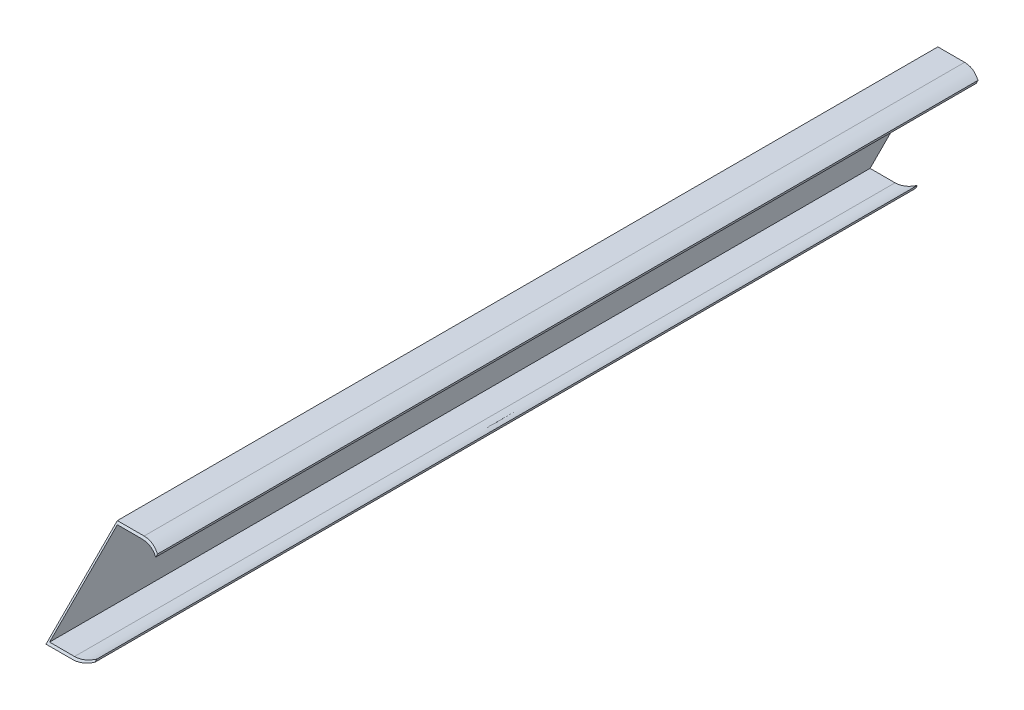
ISO-10303-21;
HEADER;
FILE_DESCRIPTION(('STEP AP214'),'2;1');
FILE_NAME('part.step','',(''),(''),'','','');
FILE_SCHEMA(('AUTOMOTIVE_DESIGN { 1 0 10303 214 1 1 1 1 }'));
ENDSEC;
DATA;
#1=APPLICATION_CONTEXT('core data for automotive mechanical design processes');
#2=APPLICATION_PROTOCOL_DEFINITION('international standard','automotive_design',2000,#1);
#3=PRODUCT_CONTEXT('',#1,'mechanical');
#4=PRODUCT('Part','Part','',(#3));
#5=PRODUCT_RELATED_PRODUCT_CATEGORY('part','',(#4));
#6=PRODUCT_DEFINITION_FORMATION('','',#4);
#7=PRODUCT_DEFINITION_CONTEXT('part definition',#1,'design');
#8=PRODUCT_DEFINITION('design','',#6,#7);
#9=PRODUCT_DEFINITION_SHAPE('','',#8);
#10=(LENGTH_UNIT() NAMED_UNIT(*) SI_UNIT(.MILLI.,.METRE.));
#11=(NAMED_UNIT(*) PLANE_ANGLE_UNIT() SI_UNIT($,.RADIAN.));
#12=(NAMED_UNIT(*) SI_UNIT($,.STERADIAN.) SOLID_ANGLE_UNIT());
#13=UNCERTAINTY_MEASURE_WITH_UNIT(LENGTH_MEASURE(1.E-05),#10,'distance_accuracy_value','');
#14=(GEOMETRIC_REPRESENTATION_CONTEXT(3) GLOBAL_UNCERTAINTY_ASSIGNED_CONTEXT((#13)) GLOBAL_UNIT_ASSIGNED_CONTEXT((#10,
#11,#12)) REPRESENTATION_CONTEXT('',''));
#15=CARTESIAN_POINT('',(0.,0.,0.));
#16=DIRECTION('',(0.,0.,1.));
#17=DIRECTION('',(1.,0.,0.));
#18=AXIS2_PLACEMENT_3D('',#15,#16,#17);
#19=CARTESIAN_POINT('',(0.,0.,1000.));
#20=DIRECTION('',(0.,1.,0.));
#21=DIRECTION('',(0.,0.,1.));
#22=AXIS2_PLACEMENT_3D('',#19,#20,#21);
#23=PLANE('',#22);
#24=DIRECTION('',(0.,0.,-1.));
#25=VECTOR('',#24,1.);
#26=CARTESIAN_POINT('',(0.,0.,1000.));
#27=LINE('',#26,#25);
#28=CARTESIAN_POINT('',(0.,0.,1000.));
#29=VERTEX_POINT('',#28);
#30=CARTESIAN_POINT('',(0.,0.,79.9999999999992));
#31=VERTEX_POINT('',#30);
#32=EDGE_CURVE('E148',#29,#31,#27,.T.);
#33=ORIENTED_EDGE('',*,*,#32,.T.);
#34=DIRECTION('',(-1.,0.,0.));
#35=VECTOR('',#34,1.);
#36=CARTESIAN_POINT('',(50.001,0.,79.9999999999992));
#37=LINE('',#36,#35);
#38=CARTESIAN_POINT('',(30.,0.,79.9999999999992));
#39=VERTEX_POINT('',#38);
#40=EDGE_CURVE('E340',#39,#31,#37,.T.);
#41=ORIENTED_EDGE('',*,*,#40,.F.);
#42=DIRECTION('',(0.,0.,-1.));
#43=VECTOR('',#42,1.);
#44=CARTESIAN_POINT('',(30.,0.,1000.));
#45=LINE('',#44,#43);
#46=CARTESIAN_POINT('',(30.,0.,1000.));
#47=VERTEX_POINT('',#46);
#48=EDGE_CURVE('E11',#47,#39,#45,.T.);
#49=ORIENTED_EDGE('',*,*,#48,.F.);
#50=DIRECTION('',(1.,0.,0.));
#51=VECTOR('',#50,1.);
#52=CARTESIAN_POINT('',(0.,0.,1000.));
#53=LINE('',#52,#51);
#54=EDGE_CURVE('E128',#29,#47,#53,.T.);
#55=ORIENTED_EDGE('',*,*,#54,.F.);
#56=EDGE_LOOP('',(#33,#41,#49,#55));
#57=FACE_BOUND('',#56,.T.);
#58=ADVANCED_FACE('F32',(#57),#23,.F.);
#59=CARTESIAN_POINT('',(30.,0.,1000.));
#60=CARTESIAN_POINT('',(40.6032812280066,0.0484567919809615,1000.));
#61=CARTESIAN_POINT('',(50.,5.,1000.));
#62=B_SPLINE_CURVE_WITH_KNOTS('',2,(#59,#60,#61),.UNSPECIFIED.,.F.,.F.,(3,3),(0.,1.),.UNSPECIFIED.);
#63=DIRECTION('',(0.,0.,-1.));
#64=VECTOR('',#63,1.);
#65=SURFACE_OF_LINEAR_EXTRUSION('',#62,#64);
#66=ORIENTED_EDGE('',*,*,#48,.T.);
#67=CARTESIAN_POINT('',(50.,5.,74.9999999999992));
#68=CARTESIAN_POINT('',(49.5210550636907,4.74761460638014,75.2523853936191));
#69=CARTESIAN_POINT('',(49.034728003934,4.50214773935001,75.4978522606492));
#70=CARTESIAN_POINT('',(48.0467010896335,4.02606279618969,75.9739372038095));
#71=CARTESIAN_POINT('',(47.5449794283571,3.7954673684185,76.2045326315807));
#72=CARTESIAN_POINT('',(46.5267291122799,3.35078644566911,76.6492135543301));
#73=CARTESIAN_POINT('',(46.0101932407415,3.13670919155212,76.8632908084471));
#74=CARTESIAN_POINT('',(44.9634416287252,2.7267907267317,77.2732092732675));
#75=CARTESIAN_POINT('',(44.4332389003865,2.530932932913,77.4690670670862));
#76=CARTESIAN_POINT('',(43.3596325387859,2.15871016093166,77.8412898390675));
#77=CARTESIAN_POINT('',(42.8162357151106,1.98233537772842,78.0176646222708));
#78=CARTESIAN_POINT('',(41.7171702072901,1.65035131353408,78.3496486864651));
#79=CARTESIAN_POINT('',(41.1615076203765,1.49473197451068,78.5052680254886));
#80=CARTESIAN_POINT('',(40.1825845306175,1.24237137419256,78.7576286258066));
#81=CARTESIAN_POINT('',(39.7618260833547,1.14075340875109,78.8592465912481));
#82=CARTESIAN_POINT('',(38.9146879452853,0.950024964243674,79.0499750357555));
#83=CARTESIAN_POINT('',(38.4883085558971,0.860913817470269,79.1390861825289));
#84=CARTESIAN_POINT('',(37.6310401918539,0.695625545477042,79.3043744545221));
#85=CARTESIAN_POINT('',(37.2001563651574,0.61943507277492,79.3805649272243));
#86=CARTESIAN_POINT('',(36.3341748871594,0.480132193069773,79.5198678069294));
#87=CARTESIAN_POINT('',(35.8990771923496,0.417019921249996,79.5829800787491));
#88=CARTESIAN_POINT('',(35.0123765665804,0.302350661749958,79.6976493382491));
#89=CARTESIAN_POINT('',(34.5606694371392,0.251196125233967,79.7488038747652));
#90=CARTESIAN_POINT('',(33.6544975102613,0.163011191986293,79.8369888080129));
#91=CARTESIAN_POINT('',(33.2000326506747,0.125981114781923,79.8740188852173));
#92=CARTESIAN_POINT('',(32.2884626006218,0.0659644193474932,79.9340355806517));
#93=CARTESIAN_POINT('',(31.831354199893,0.0430022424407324,79.9569977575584));
#94=CARTESIAN_POINT('',(30.9161801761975,0.0110581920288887,79.9889418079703));
#95=CARTESIAN_POINT('',(30.4581145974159,0.00207568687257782,79.9979243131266));
#96=CARTESIAN_POINT('',(30.,0.,79.9999999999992));
#97=B_SPLINE_CURVE_WITH_KNOTS('',3,(#67,#68,#69,#70,#71,#72,#73,#74,#75,#76,#77,#78,#79,#80,#81,
#82,#83,#84,#85,#86,#87,#88,#89,#90,#91,#92,#93,#94,#95,#96),.UNSPECIFIED.,.F.,.F.,(4,2,2,2,2,2,
2,2,2,2,2,2,2,2,4),(0.,1.7919271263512,3.58652177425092,5.38200602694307,7.17583972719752,
8.96876650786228,10.7608212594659,12.094332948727,13.4277734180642,14.7598278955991,
16.0918961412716,17.4638388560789,18.8358126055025,20.2101632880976,21.5844518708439),.UNSPECIFIED.);
#98=CARTESIAN_POINT('',(50.,5.,74.9999999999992));
#99=VERTEX_POINT('',#98);
#100=EDGE_CURVE('E338',#99,#39,#97,.T.);
#101=ORIENTED_EDGE('',*,*,#100,.F.);
#102=DIRECTION('',(0.,0.,-1.));
#103=VECTOR('',#102,1.);
#104=CARTESIAN_POINT('',(50.,5.,1000.));
#105=LINE('',#104,#103);
#106=CARTESIAN_POINT('',(50.,5.,995.));
#107=VERTEX_POINT('',#106);
#108=EDGE_CURVE('E41',#107,#99,#105,.T.);
#109=ORIENTED_EDGE('',*,*,#108,.F.);
#110=CARTESIAN_POINT('',(30.,0.,1000.));
#111=CARTESIAN_POINT('',(30.2965221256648,0.00135208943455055,999.998647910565));
#112=CARTESIAN_POINT('',(30.5930205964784,0.00558904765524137,999.994410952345));
#113=CARTESIAN_POINT('',(31.1856963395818,0.0198889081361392,999.980111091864));
#114=CARTESIAN_POINT('',(31.4818736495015,0.029951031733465,999.970048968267));
#115=CARTESIAN_POINT('',(32.0736889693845,0.0559567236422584,999.944043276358));
#116=CARTESIAN_POINT('',(32.3693270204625,0.0718998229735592,999.928100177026));
#117=CARTESIAN_POINT('',(32.959735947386,0.109694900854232,999.890305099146));
#118=CARTESIAN_POINT('',(33.2545071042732,0.131544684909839,999.86845531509));
#119=CARTESIAN_POINT('',(33.8430758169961,0.181175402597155,999.818824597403));
#120=CARTESIAN_POINT('',(34.1368732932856,0.208956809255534,999.791043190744));
#121=CARTESIAN_POINT('',(34.7232698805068,0.270449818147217,999.729550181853));
#122=CARTESIAN_POINT('',(35.0158687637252,0.304162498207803,999.695837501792));
#123=CARTESIAN_POINT('',(35.8889009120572,0.413848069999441,999.586151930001));
#124=CARTESIAN_POINT('',(36.467182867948,0.498588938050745,999.501411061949));
#125=CARTESIAN_POINT('',(37.6162181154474,0.691147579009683,999.30885242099));
#126=CARTESIAN_POINT('',(38.186968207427,0.798974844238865,999.201025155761));
#127=CARTESIAN_POINT('',(39.3191210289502,1.03701619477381,998.962983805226));
#128=CARTESIAN_POINT('',(39.880522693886,1.16723281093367,998.832767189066));
#129=CARTESIAN_POINT('',(40.993487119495,1.44938335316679,998.550616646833));
#130=CARTESIAN_POINT('',(41.5450291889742,1.60135801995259,998.398641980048));
#131=CARTESIAN_POINT('',(42.6358830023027,1.92568946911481,998.074310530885));
#132=CARTESIAN_POINT('',(43.1751963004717,2.09804364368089,997.901956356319));
#133=CARTESIAN_POINT('',(44.2406108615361,2.4618560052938,997.538143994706));
#134=CARTESIAN_POINT('',(44.7667154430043,2.65330933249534,997.346690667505));
#135=CARTESIAN_POINT('',(45.5602041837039,2.95948974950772,997.040510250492));
#136=CARTESIAN_POINT('',(45.8325761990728,3.06781364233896,996.932186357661));
#137=CARTESIAN_POINT('',(46.3733730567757,3.28921123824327,996.710788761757));
#138=CARTESIAN_POINT('',(46.6417986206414,3.40228405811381,996.597715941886));
#139=CARTESIAN_POINT('',(47.174672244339,3.63298659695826,996.367013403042));
#140=CARTESIAN_POINT('',(47.4391205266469,3.75061605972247,996.249383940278));
#141=CARTESIAN_POINT('',(48.485464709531,4.22828118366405,995.771718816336));
#142=CARTESIAN_POINT('',(49.251639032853,4.60563986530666,995.394360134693));
#143=CARTESIAN_POINT('',(50.,5.00000000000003,995.));
#144=B_SPLINE_CURVE_WITH_KNOTS('',3,(#110,#111,#112,#113,#114,#115,#116,#117,#118,#119,#120,
#121,#122,#123,#124,#125,#126,#127,#128,#129,#130,#131,#132,#133,#134,#135,#136,#137,#138,#139,
#140,#141,#142,#143),.UNSPECIFIED.,.F.,.F.,(4,2,2,2,2,2,2,2,2,2,2,2,2,2,2,2,4),(0.,
0.889560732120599,1.77900258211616,2.66837351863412,3.55741448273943,4.44652637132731,
5.33579999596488,7.10646365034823,8.87785674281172,10.6494502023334,12.4244053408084,
14.1991335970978,15.9734114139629,16.9108234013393,17.8480618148,18.7852476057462,
21.5842762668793),.UNSPECIFIED.);
#145=EDGE_CURVE('E129',#47,#107,#144,.T.);
#146=ORIENTED_EDGE('',*,*,#145,.F.);
#147=EDGE_LOOP('',(#66,#101,#109,#146));
#148=FACE_BOUND('',#147,.T.);
#149=ADVANCED_FACE('F353',(#148),#65,.F.);
#150=CARTESIAN_POINT('',(50.,5.,1000.));
#151=DIRECTION('',(-1.,0.,0.));
#152=DIRECTION('',(0.,0.,1.));
#153=AXIS2_PLACEMENT_3D('',#150,#151,#152);
#154=PLANE('',#153);
#155=ORIENTED_EDGE('',*,*,#108,.T.);
#156=DIRECTION('',(0.,-0.707106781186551,0.707106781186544));
#157=VECTOR('',#156,1.);
#158=CARTESIAN_POINT('',(50.,0.,79.9999999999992));
#159=LINE('',#158,#157);
#160=CARTESIAN_POINT('',(50.,7.00000000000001,72.9999999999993));
#161=VERTEX_POINT('',#160);
#162=EDGE_CURVE('E311',#161,#99,#159,.T.);
#163=ORIENTED_EDGE('',*,*,#162,.F.);
#164=DIRECTION('',(0.,0.,-1.));
#165=VECTOR('',#164,1.);
#166=CARTESIAN_POINT('',(50.,7.00000000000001,1000.));
#167=LINE('',#166,#165);
#168=CARTESIAN_POINT('',(50.,7.00000000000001,993.));
#169=VERTEX_POINT('',#168);
#170=EDGE_CURVE('E174',#169,#161,#167,.T.);
#171=ORIENTED_EDGE('',*,*,#170,.F.);
#172=DIRECTION('',(0.,0.707106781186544,-0.707106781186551));
#173=VECTOR('',#172,1.);
#174=CARTESIAN_POINT('',(50.,0.,1000.));
#175=LINE('',#174,#173);
#176=EDGE_CURVE('E184',#107,#169,#175,.T.);
#177=ORIENTED_EDGE('',*,*,#176,.F.);
#178=EDGE_LOOP('',(#155,#163,#171,#177));
#179=FACE_BOUND('',#178,.T.);
#180=ADVANCED_FACE('F357',(#179),#154,.F.);
#181=CARTESIAN_POINT('',(50.,7.00000000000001,1000.));
#182=CARTESIAN_POINT('',(40.6032812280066,2.04845679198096,1000.));
#183=CARTESIAN_POINT('',(30.,2.,1000.));
#184=B_SPLINE_CURVE_WITH_KNOTS('',2,(#181,#182,#183),.UNSPECIFIED.,.F.,.F.,(3,3),(0.,1.),.UNSPECIFIED.);
#185=DIRECTION('',(0.,0.,-1.));
#186=VECTOR('',#185,1.);
#187=SURFACE_OF_LINEAR_EXTRUSION('',#184,#186);
#188=ORIENTED_EDGE('',*,*,#170,.T.);
#189=CARTESIAN_POINT('',(30.,2.,77.9999999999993));
#190=CARTESIAN_POINT('',(30.2965221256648,2.00135208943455,77.9986479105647));
#191=CARTESIAN_POINT('',(30.5930205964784,2.00558904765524,77.994410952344));
#192=CARTESIAN_POINT('',(31.1856963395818,2.01988890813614,77.980111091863));
#193=CARTESIAN_POINT('',(31.4818736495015,2.02995103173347,77.9700489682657));
#194=CARTESIAN_POINT('',(32.0736889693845,2.05595672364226,77.9440432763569));
#195=CARTESIAN_POINT('',(32.3693270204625,2.07189982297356,77.9281001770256));
#196=CARTESIAN_POINT('',(32.9597359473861,2.10969490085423,77.890305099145));
#197=CARTESIAN_POINT('',(33.2545071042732,2.13154468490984,77.8684553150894));
#198=CARTESIAN_POINT('',(33.8430758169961,2.18117540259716,77.818824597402));
#199=CARTESIAN_POINT('',(34.1368732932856,2.20895680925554,77.7910431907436));
#200=CARTESIAN_POINT('',(34.7232698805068,2.27044981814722,77.729550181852));
#201=CARTESIAN_POINT('',(35.0158687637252,2.3041624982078,77.6958375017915));
#202=CARTESIAN_POINT('',(35.8889009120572,2.41384806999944,77.5861519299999));
#203=CARTESIAN_POINT('',(36.467182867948,2.49858893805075,77.5014110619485));
#204=CARTESIAN_POINT('',(37.6162181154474,2.69114757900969,77.3088524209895));
#205=CARTESIAN_POINT('',(38.186968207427,2.79897484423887,77.2010251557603));
#206=CARTESIAN_POINT('',(39.3191210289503,3.03701619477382,76.9629838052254));
#207=CARTESIAN_POINT('',(39.8805226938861,3.16723281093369,76.8327671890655));
#208=CARTESIAN_POINT('',(40.9934871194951,3.44938335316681,76.5506166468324));
#209=CARTESIAN_POINT('',(41.5450291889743,3.60135801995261,76.3986419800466));
#210=CARTESIAN_POINT('',(42.6358830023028,3.92568946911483,76.0743105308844));
#211=CARTESIAN_POINT('',(43.1751963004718,4.09804364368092,75.9019563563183));
#212=CARTESIAN_POINT('',(44.2406108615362,4.46185600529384,75.5381439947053));
#213=CARTESIAN_POINT('',(44.7667154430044,4.65330933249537,75.3466906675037));
#214=CARTESIAN_POINT('',(45.560204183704,4.95948974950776,75.0405102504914));
#215=CARTESIAN_POINT('',(45.8325761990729,5.06781364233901,74.9321863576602));
#216=CARTESIAN_POINT('',(46.3733730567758,5.28921123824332,74.7107887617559));
#217=CARTESIAN_POINT('',(46.6417986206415,5.40228405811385,74.5977159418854));
#218=CARTESIAN_POINT('',(47.174672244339,5.63298659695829,74.3670134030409));
#219=CARTESIAN_POINT('',(47.439120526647,5.7506160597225,74.2493839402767));
#220=CARTESIAN_POINT('',(48.485464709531,6.22828118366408,73.7717188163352));
#221=CARTESIAN_POINT('',(49.2516390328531,6.6056398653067,73.3943601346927));
#222=CARTESIAN_POINT('',(50.,7.00000000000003,72.9999999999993));
#223=B_SPLINE_CURVE_WITH_KNOTS('',3,(#189,#190,#191,#192,#193,#194,#195,#196,#197,#198,#199,
#200,#201,#202,#203,#204,#205,#206,#207,#208,#209,#210,#211,#212,#213,#214,#215,#216,#217,#218,
#219,#220,#221,#222),.UNSPECIFIED.,.F.,.F.,(4,2,2,2,2,2,2,2,2,2,2,2,2,2,2,2,4),(0.,
0.889560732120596,1.77900258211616,2.66837351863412,3.55741448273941,4.44652637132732,
5.33579999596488,7.10646365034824,8.87785674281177,10.6494502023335,12.4244053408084,
14.1991335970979,15.973411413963,16.9108234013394,17.8480618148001,18.7852476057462,
21.5842762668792),.UNSPECIFIED.);
#224=CARTESIAN_POINT('',(30.,2.,77.9999999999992));
#225=VERTEX_POINT('',#224);
#226=EDGE_CURVE('E299',#225,#161,#223,.T.);
#227=ORIENTED_EDGE('',*,*,#226,.F.);
#228=DIRECTION('',(0.,0.,-1.));
#229=VECTOR('',#228,1.);
#230=CARTESIAN_POINT('',(30.,2.,1000.));
#231=LINE('',#230,#229);
#232=CARTESIAN_POINT('',(30.,2.,998.));
#233=VERTEX_POINT('',#232);
#234=EDGE_CURVE('E170',#233,#225,#231,.T.);
#235=ORIENTED_EDGE('',*,*,#234,.F.);
#236=CARTESIAN_POINT('',(50.,7.00000000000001,993.));
#237=CARTESIAN_POINT('',(49.5210550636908,6.74761460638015,993.25238539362));
#238=CARTESIAN_POINT('',(49.034728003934,6.50214773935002,993.49785226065));
#239=CARTESIAN_POINT('',(48.0467010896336,6.02606279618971,993.97393720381));
#240=CARTESIAN_POINT('',(47.5449794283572,5.79546736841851,994.204532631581));
#241=CARTESIAN_POINT('',(46.5267291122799,5.35078644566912,994.649213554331));
#242=CARTESIAN_POINT('',(46.0101932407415,5.13670919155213,994.863290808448));
#243=CARTESIAN_POINT('',(44.9634416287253,4.72679072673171,995.273209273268));
#244=CARTESIAN_POINT('',(44.4332389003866,4.53093293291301,995.469067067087));
#245=CARTESIAN_POINT('',(43.3596325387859,4.15871016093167,995.841289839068));
#246=CARTESIAN_POINT('',(42.8162357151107,3.98233537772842,996.017664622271));
#247=CARTESIAN_POINT('',(41.7171702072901,3.6503513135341,996.349648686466));
#248=CARTESIAN_POINT('',(41.1615076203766,3.49473197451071,996.505268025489));
#249=CARTESIAN_POINT('',(40.1825845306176,3.24237137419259,996.757628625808));
#250=CARTESIAN_POINT('',(39.7618260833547,3.1407534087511,996.859246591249));
#251=CARTESIAN_POINT('',(38.9146879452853,2.95002496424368,997.049975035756));
#252=CARTESIAN_POINT('',(38.4883085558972,2.86091381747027,997.13908618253));
#253=CARTESIAN_POINT('',(37.6310401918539,2.69562554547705,997.304374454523));
#254=CARTESIAN_POINT('',(37.2001563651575,2.61943507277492,997.380564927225));
#255=CARTESIAN_POINT('',(36.3341748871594,2.48013219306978,997.51986780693));
#256=CARTESIAN_POINT('',(35.8990771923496,2.41701992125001,997.58298007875));
#257=CARTESIAN_POINT('',(35.0123765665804,2.30235066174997,997.69764933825));
#258=CARTESIAN_POINT('',(34.5606694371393,2.25119612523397,997.748803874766));
#259=CARTESIAN_POINT('',(33.6544975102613,2.16301119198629,997.836988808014));
#260=CARTESIAN_POINT('',(33.2000326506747,2.12598111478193,997.874018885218));
#261=CARTESIAN_POINT('',(32.2884626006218,2.0659644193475,997.934035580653));
#262=CARTESIAN_POINT('',(31.831354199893,2.04300224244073,997.956997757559));
#263=CARTESIAN_POINT('',(30.9161801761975,2.01105819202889,997.988941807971));
#264=CARTESIAN_POINT('',(30.4581145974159,2.00207568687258,997.997924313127));
#265=CARTESIAN_POINT('',(30.,2.00000000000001,998.));
#266=B_SPLINE_CURVE_WITH_KNOTS('',3,(#236,#237,#238,#239,#240,#241,#242,#243,#244,#245,#246,
#247,#248,#249,#250,#251,#252,#253,#254,#255,#256,#257,#258,#259,#260,#261,#262,#263,#264,#265),
.UNSPECIFIED.,.F.,.F.,(4,2,2,2,2,2,2,2,2,2,2,2,2,2,4),(0.,1.79192712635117,3.58652177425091,
5.38200602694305,7.1758397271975,8.96876650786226,10.7608212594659,12.094332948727,
13.4277734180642,14.7598278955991,16.0918961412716,17.4638388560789,18.8358126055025,
20.2101632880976,21.5844518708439),.UNSPECIFIED.);
#267=EDGE_CURVE('E186',#169,#233,#266,.T.);
#268=ORIENTED_EDGE('',*,*,#267,.F.);
#269=EDGE_LOOP('',(#188,#227,#235,#268));
#270=FACE_BOUND('',#269,.T.);
#271=ADVANCED_FACE('F362',(#270),#187,.F.);
#272=CARTESIAN_POINT('',(2.,2.,1000.));
#273=DIRECTION('',(0.,-1.,0.));
#274=DIRECTION('',(0.,0.,-1.));
#275=AXIS2_PLACEMENT_3D('',#272,#273,#274);
#276=PLANE('',#275);
#277=ORIENTED_EDGE('',*,*,#234,.T.);
#278=DIRECTION('',(1.,0.,0.));
#279=VECTOR('',#278,1.);
#280=CARTESIAN_POINT('',(50.001,2.,77.9999999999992));
#281=LINE('',#280,#279);
#282=CARTESIAN_POINT('',(2.,2.,77.9999999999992));
#283=VERTEX_POINT('',#282);
#284=EDGE_CURVE('E295',#283,#225,#281,.T.);
#285=ORIENTED_EDGE('',*,*,#284,.F.);
#286=DIRECTION('',(0.,0.,-1.));
#287=VECTOR('',#286,1.);
#288=CARTESIAN_POINT('',(2.,2.,1000.));
#289=LINE('',#288,#287);
#290=CARTESIAN_POINT('',(2.,2.,998.));
#291=VERTEX_POINT('',#290);
#292=EDGE_CURVE('E175',#291,#283,#289,.T.);
#293=ORIENTED_EDGE('',*,*,#292,.F.);
#294=DIRECTION('',(-1.,0.,0.));
#295=VECTOR('',#294,1.);
#296=CARTESIAN_POINT('',(50.001,2.,998.));
#297=LINE('',#296,#295);
#298=EDGE_CURVE('E363',#233,#291,#297,.T.);
#299=ORIENTED_EDGE('',*,*,#298,.F.);
#300=EDGE_LOOP('',(#277,#285,#293,#299));
#301=FACE_BOUND('',#300,.T.);
#302=ADVANCED_FACE('F392',(#301),#276,.F.);
#303=CARTESIAN_POINT('',(2.,78.,1000.));
#304=DIRECTION('',(-1.,0.,0.));
#305=DIRECTION('',(0.,0.,1.));
#306=AXIS2_PLACEMENT_3D('',#303,#304,#305);
#307=PLANE('',#306);
#308=ORIENTED_EDGE('',*,*,#292,.T.);
#309=DIRECTION('',(0.,-0.707106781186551,0.707106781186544));
#310=VECTOR('',#309,1.);
#311=CARTESIAN_POINT('',(2.,0.,79.9999999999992));
#312=LINE('',#311,#310);
#313=CARTESIAN_POINT('',(2.,78.,1.99999999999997));
#314=VERTEX_POINT('',#313);
#315=EDGE_CURVE('E291',#314,#283,#312,.T.);
#316=ORIENTED_EDGE('',*,*,#315,.F.);
#317=DIRECTION('',(0.,0.,-1.));
#318=VECTOR('',#317,1.);
#319=CARTESIAN_POINT('',(2.,78.,1000.));
#320=LINE('',#319,#318);
#321=CARTESIAN_POINT('',(2.,78.,921.999999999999));
#322=VERTEX_POINT('',#321);
#323=EDGE_CURVE('E169',#322,#314,#320,.T.);
#324=ORIENTED_EDGE('',*,*,#323,.F.);
#325=DIRECTION('',(0.,0.707106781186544,-0.707106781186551));
#326=VECTOR('',#325,1.);
#327=CARTESIAN_POINT('',(2.,0.,1000.));
#328=LINE('',#327,#326);
#329=EDGE_CURVE('E248',#291,#322,#328,.T.);
#330=ORIENTED_EDGE('',*,*,#329,.F.);
#331=EDGE_LOOP('',(#308,#316,#324,#330));
#332=FACE_BOUND('',#331,.T.);
#333=ADVANCED_FACE('F395',(#332),#307,.F.);
#334=CARTESIAN_POINT('',(2.,78.,1000.));
#335=DIRECTION('',(0.,1.,0.));
#336=DIRECTION('',(0.,0.,1.));
#337=AXIS2_PLACEMENT_3D('',#334,#335,#336);
#338=PLANE('',#337);
#339=ORIENTED_EDGE('',*,*,#323,.T.);
#340=DIRECTION('',(-1.,0.,0.));
#341=VECTOR('',#340,1.);
#342=CARTESIAN_POINT('',(50.001,78.,1.99999999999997));
#343=LINE('',#342,#341);
#344=CARTESIAN_POINT('',(30.,78.,1.99999999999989));
#345=VERTEX_POINT('',#344);
#346=EDGE_CURVE('E296',#345,#314,#343,.T.);
#347=ORIENTED_EDGE('',*,*,#346,.F.);
#348=DIRECTION('',(0.,0.,-1.));
#349=VECTOR('',#348,1.);
#350=CARTESIAN_POINT('',(30.,78.,1000.));
#351=LINE('',#350,#349);
#352=CARTESIAN_POINT('',(30.,78.,921.999999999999));
#353=VERTEX_POINT('',#352);
#354=EDGE_CURVE('E166',#353,#345,#351,.T.);
#355=ORIENTED_EDGE('',*,*,#354,.F.);
#356=DIRECTION('',(1.,0.,0.));
#357=VECTOR('',#356,1.);
#358=CARTESIAN_POINT('',(50.001,78.,921.999999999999));
#359=LINE('',#358,#357);
#360=EDGE_CURVE('E246',#322,#353,#359,.T.);
#361=ORIENTED_EDGE('',*,*,#360,.F.);
#362=EDGE_LOOP('',(#339,#347,#355,#361));
#363=FACE_BOUND('',#362,.T.);
#364=ADVANCED_FACE('F399',(#363),#338,.F.);
#365=CARTESIAN_POINT('',(30.,78.,1000.));
#366=CARTESIAN_POINT('',(40.6032812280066,77.951543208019,1000.));
#367=CARTESIAN_POINT('',(50.,73.,1000.));
#368=B_SPLINE_CURVE_WITH_KNOTS('',2,(#365,#366,#367),.UNSPECIFIED.,.F.,.F.,(3,3),(0.,1.),.UNSPECIFIED.);
#369=DIRECTION('',(0.,0.,-1.));
#370=VECTOR('',#369,1.);
#371=SURFACE_OF_LINEAR_EXTRUSION('',#368,#370);
#372=ORIENTED_EDGE('',*,*,#354,.T.);
#373=CARTESIAN_POINT('',(50.,73.,6.9999999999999));
#374=CARTESIAN_POINT('',(49.5210550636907,73.2523853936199,6.74761460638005));
#375=CARTESIAN_POINT('',(49.0347280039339,73.49785226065,6.50214773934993));
#376=CARTESIAN_POINT('',(48.0467010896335,73.9739372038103,6.02606279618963));
#377=CARTESIAN_POINT('',(47.5449794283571,74.2045326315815,5.79546736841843));
#378=CARTESIAN_POINT('',(46.5267291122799,74.6492135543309,5.35078644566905));
#379=CARTESIAN_POINT('',(46.0101932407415,74.8632908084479,5.13670919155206));
#380=CARTESIAN_POINT('',(44.9634416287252,75.2732092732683,4.72679072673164));
#381=CARTESIAN_POINT('',(44.4332389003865,75.469067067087,4.53093293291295));
#382=CARTESIAN_POINT('',(43.3596325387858,75.8412898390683,4.15871016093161));
#383=CARTESIAN_POINT('',(42.8162357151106,76.0176646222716,3.98233537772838));
#384=CARTESIAN_POINT('',(41.7171702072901,76.3496486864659,3.65035131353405));
#385=CARTESIAN_POINT('',(41.1615076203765,76.5052680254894,3.49473197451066));
#386=CARTESIAN_POINT('',(40.1825845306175,76.7576286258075,3.24237137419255));
#387=CARTESIAN_POINT('',(39.7618260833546,76.8592465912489,3.14075340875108));
#388=CARTESIAN_POINT('',(38.9146879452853,77.0499750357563,2.95002496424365));
#389=CARTESIAN_POINT('',(38.4883085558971,77.1390861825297,2.86091381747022));
#390=CARTESIAN_POINT('',(37.6310401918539,77.304374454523,2.69562554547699));
#391=CARTESIAN_POINT('',(37.2001563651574,77.3805649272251,2.61943507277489));
#392=CARTESIAN_POINT('',(36.3341748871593,77.5198678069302,2.48013219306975));
#393=CARTESIAN_POINT('',(35.8990771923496,77.58298007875,2.41701992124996));
#394=CARTESIAN_POINT('',(35.0123765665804,77.69764933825,2.30235066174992));
#395=CARTESIAN_POINT('',(34.5606694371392,77.748803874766,2.25119612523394));
#396=CARTESIAN_POINT('',(33.6544975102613,77.8369888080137,2.16301119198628));
#397=CARTESIAN_POINT('',(33.2000326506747,77.8740188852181,2.12598111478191));
#398=CARTESIAN_POINT('',(32.2884626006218,77.9340355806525,2.06596441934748));
#399=CARTESIAN_POINT('',(31.831354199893,77.9569977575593,2.04300224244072));
#400=CARTESIAN_POINT('',(30.9161801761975,77.9889418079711,2.01105819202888));
#401=CARTESIAN_POINT('',(30.4581145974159,77.9979243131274,2.00207568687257));
#402=CARTESIAN_POINT('',(30.,78.,2.00000000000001));
#403=B_SPLINE_CURVE_WITH_KNOTS('',3,(#373,#374,#375,#376,#377,#378,#379,#380,#381,#382,#383,
#384,#385,#386,#387,#388,#389,#390,#391,#392,#393,#394,#395,#396,#397,#398,#399,#400,#401,#402),
.UNSPECIFIED.,.F.,.F.,(4,2,2,2,2,2,2,2,2,2,2,2,2,2,4),(0.,1.7919271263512,3.5865217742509,
5.38200602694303,7.17583972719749,8.96876650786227,10.7608212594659,12.094332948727,
13.4277734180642,14.759827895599,16.0918961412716,17.4638388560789,18.8358126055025,
20.2101632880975,21.5844518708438),.UNSPECIFIED.);
#404=CARTESIAN_POINT('',(50.,73.,6.99999999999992));
#405=VERTEX_POINT('',#404);
#406=EDGE_CURVE('E266',#405,#345,#403,.T.);
#407=ORIENTED_EDGE('',*,*,#406,.F.);
#408=DIRECTION('',(0.,0.,-1.));
#409=VECTOR('',#408,1.);
#410=CARTESIAN_POINT('',(50.,73.,1000.));
#411=LINE('',#410,#409);
#412=CARTESIAN_POINT('',(50.,73.,926.999999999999));
#413=VERTEX_POINT('',#412);
#414=EDGE_CURVE('E146',#413,#405,#411,.T.);
#415=ORIENTED_EDGE('',*,*,#414,.F.);
#416=CARTESIAN_POINT('',(30.,78.,921.999999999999));
#417=CARTESIAN_POINT('',(30.2965221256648,77.9986479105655,922.001352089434));
#418=CARTESIAN_POINT('',(30.5930205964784,77.9944109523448,922.005589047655));
#419=CARTESIAN_POINT('',(31.1856963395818,77.9801110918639,922.019888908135));
#420=CARTESIAN_POINT('',(31.4818736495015,77.9700489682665,922.029951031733));
#421=CARTESIAN_POINT('',(32.0736889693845,77.9440432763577,922.055956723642));
#422=CARTESIAN_POINT('',(32.3693270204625,77.9281001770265,922.071899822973));
#423=CARTESIAN_POINT('',(32.9597359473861,77.8903050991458,922.109694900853));
#424=CARTESIAN_POINT('',(33.2545071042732,77.8684553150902,922.131544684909));
#425=CARTESIAN_POINT('',(33.8430758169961,77.8188245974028,922.181175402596));
#426=CARTESIAN_POINT('',(34.1368732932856,77.7910431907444,922.208956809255));
#427=CARTESIAN_POINT('',(34.7232698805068,77.7295501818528,922.270449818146));
#428=CARTESIAN_POINT('',(35.0158687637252,77.6958375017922,922.304162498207));
#429=CARTESIAN_POINT('',(35.8889009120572,77.5861519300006,922.413848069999));
#430=CARTESIAN_POINT('',(36.467182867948,77.5014110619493,922.49858893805));
#431=CARTESIAN_POINT('',(37.6162181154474,77.3088524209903,922.691147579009));
#432=CARTESIAN_POINT('',(38.186968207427,77.2010251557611,922.798974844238));
#433=CARTESIAN_POINT('',(39.3191210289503,76.9629838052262,923.037016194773));
#434=CARTESIAN_POINT('',(39.880522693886,76.8327671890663,923.167232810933));
#435=CARTESIAN_POINT('',(40.993487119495,76.5506166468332,923.449383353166));
#436=CARTESIAN_POINT('',(41.5450291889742,76.3986419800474,923.601358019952));
#437=CARTESIAN_POINT('',(42.6358830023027,76.0743105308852,923.925689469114));
#438=CARTESIAN_POINT('',(43.1751963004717,75.9019563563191,924.09804364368));
#439=CARTESIAN_POINT('',(44.2406108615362,75.5381439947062,924.461856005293));
#440=CARTESIAN_POINT('',(44.7667154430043,75.3466906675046,924.653309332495));
#441=CARTESIAN_POINT('',(45.5602041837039,75.0405102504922,924.959489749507));
#442=CARTESIAN_POINT('',(45.8325761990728,74.932186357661,925.067813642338));
#443=CARTESIAN_POINT('',(46.3733730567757,74.7107887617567,925.289211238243));
#444=CARTESIAN_POINT('',(46.6417986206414,74.5977159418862,925.402284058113));
#445=CARTESIAN_POINT('',(47.174672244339,74.3670134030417,925.632986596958));
#446=CARTESIAN_POINT('',(47.439120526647,74.2493839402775,925.750616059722));
#447=CARTESIAN_POINT('',(48.4854647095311,73.7717188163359,926.228281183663));
#448=CARTESIAN_POINT('',(49.2516390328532,73.3943601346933,926.605639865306));
#449=CARTESIAN_POINT('',(50.,73.,926.999999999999));
#450=B_SPLINE_CURVE_WITH_KNOTS('',3,(#416,#417,#418,#419,#420,#421,#422,#423,#424,#425,#426,
#427,#428,#429,#430,#431,#432,#433,#434,#435,#436,#437,#438,#439,#440,#441,#442,#443,#444,#445,
#446,#447,#448,#449),.UNSPECIFIED.,.F.,.F.,(4,2,2,2,2,2,2,2,2,2,2,2,2,2,2,2,4),(0.,
0.889560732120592,1.77900258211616,2.66837351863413,3.55741448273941,4.44652637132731,
5.33579999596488,7.10646365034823,8.87785674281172,10.6494502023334,12.4244053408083,
14.1991335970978,15.9734114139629,16.9108234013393,17.8480618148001,18.7852476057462,
21.5842762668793),.UNSPECIFIED.);
#451=EDGE_CURVE('E244',#353,#413,#450,.T.);
#452=ORIENTED_EDGE('',*,*,#451,.F.);
#453=EDGE_LOOP('',(#372,#407,#415,#452));
#454=FACE_BOUND('',#453,.T.);
#455=ADVANCED_FACE('F403',(#454),#371,.F.);
#456=CARTESIAN_POINT('',(50.,75.,1000.));
#457=DIRECTION('',(-1.,0.,0.));
#458=DIRECTION('',(0.,0.,1.));
#459=AXIS2_PLACEMENT_3D('',#456,#457,#458);
#460=PLANE('',#459);
#461=ORIENTED_EDGE('',*,*,#414,.T.);
#462=DIRECTION('',(0.,-0.707106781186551,0.707106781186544));
#463=VECTOR('',#462,1.);
#464=CARTESIAN_POINT('',(50.,0.,79.9999999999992));
#465=LINE('',#464,#463);
#466=CARTESIAN_POINT('',(50.,75.,5.));
#467=VERTEX_POINT('',#466);
#468=EDGE_CURVE('E139',#467,#405,#465,.T.);
#469=ORIENTED_EDGE('',*,*,#468,.F.);
#470=DIRECTION('',(0.,0.,-1.));
#471=VECTOR('',#470,1.);
#472=CARTESIAN_POINT('',(50.,75.,1000.));
#473=LINE('',#472,#471);
#474=CARTESIAN_POINT('',(50.,75.,924.999999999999));
#475=VERTEX_POINT('',#474);
#476=EDGE_CURVE('E138',#475,#467,#473,.T.);
#477=ORIENTED_EDGE('',*,*,#476,.F.);
#478=DIRECTION('',(0.,0.707106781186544,-0.707106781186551));
#479=VECTOR('',#478,1.);
#480=CARTESIAN_POINT('',(50.,0.,1000.));
#481=LINE('',#480,#479);
#482=EDGE_CURVE('E251',#413,#475,#481,.T.);
#483=ORIENTED_EDGE('',*,*,#482,.F.);
#484=EDGE_LOOP('',(#461,#469,#477,#483));
#485=FACE_BOUND('',#484,.T.);
#486=ADVANCED_FACE('F407',(#485),#460,.F.);
#487=CARTESIAN_POINT('',(50.,75.,1000.));
#488=CARTESIAN_POINT('',(40.6032812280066,79.951543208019,1000.));
#489=CARTESIAN_POINT('',(30.,80.,1000.));
#490=B_SPLINE_CURVE_WITH_KNOTS('',2,(#487,#488,#489),.UNSPECIFIED.,.F.,.F.,(3,3),(0.,1.),.UNSPECIFIED.);
#491=DIRECTION('',(0.,0.,-1.));
#492=VECTOR('',#491,1.);
#493=SURFACE_OF_LINEAR_EXTRUSION('',#490,#492);
#494=ORIENTED_EDGE('',*,*,#476,.T.);
#495=CARTESIAN_POINT('',(30.0000000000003,80.,0.));
#496=CARTESIAN_POINT('',(30.296522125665,79.9986479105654,0.00135208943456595));
#497=CARTESIAN_POINT('',(30.5930205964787,79.9944109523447,0.00558904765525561));
#498=CARTESIAN_POINT('',(31.1856963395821,79.9801110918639,0.0198889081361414));
#499=CARTESIAN_POINT('',(31.4818736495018,79.9700489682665,0.0299510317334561));
#500=CARTESIAN_POINT('',(32.0736889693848,79.9440432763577,0.0559567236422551));
#501=CARTESIAN_POINT('',(32.3693270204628,79.9281001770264,0.0718998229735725));
#502=CARTESIAN_POINT('',(32.9597359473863,79.8903050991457,0.109694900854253));
#503=CARTESIAN_POINT('',(33.2545071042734,79.8684553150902,0.13154468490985));
#504=CARTESIAN_POINT('',(33.8430758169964,79.8188245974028,0.181175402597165));
#505=CARTESIAN_POINT('',(34.1368732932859,79.7910431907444,0.208956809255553));
#506=CARTESIAN_POINT('',(34.7232698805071,79.7295501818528,0.270449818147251));
#507=CARTESIAN_POINT('',(35.0158687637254,79.6958375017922,0.304162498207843));
#508=CARTESIAN_POINT('',(35.8889009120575,79.5861519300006,0.413848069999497));
#509=CARTESIAN_POINT('',(36.4671828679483,79.5014110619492,0.498588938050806));
#510=CARTESIAN_POINT('',(37.6162181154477,79.3088524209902,0.691147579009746));
#511=CARTESIAN_POINT('',(38.1869682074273,79.2010251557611,0.798974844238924));
#512=CARTESIAN_POINT('',(39.3191210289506,78.9629838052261,1.03701619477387));
#513=CARTESIAN_POINT('',(39.8805226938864,78.8327671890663,1.16723281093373));
#514=CARTESIAN_POINT('',(40.9934871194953,78.5506166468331,1.44938335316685));
#515=CARTESIAN_POINT('',(41.5450291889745,78.3986419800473,1.60135801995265));
#516=CARTESIAN_POINT('',(42.635883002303,78.0743105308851,1.92568946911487));
#517=CARTESIAN_POINT('',(43.175196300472,77.901956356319,2.09804364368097));
#518=CARTESIAN_POINT('',(44.2406108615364,77.5381439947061,2.46185600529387));
#519=CARTESIAN_POINT('',(44.7667154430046,77.3466906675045,2.65330933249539));
#520=CARTESIAN_POINT('',(45.5602041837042,77.0405102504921,2.95948974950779));
#521=CARTESIAN_POINT('',(45.8325761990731,76.9321863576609,3.06781364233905));
#522=CARTESIAN_POINT('',(46.373373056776,76.7107887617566,3.28921123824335));
#523=CARTESIAN_POINT('',(46.6417986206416,76.5977159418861,3.40228405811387));
#524=CARTESIAN_POINT('',(47.1746722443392,76.3670134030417,3.6329865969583));
#525=CARTESIAN_POINT('',(47.4391205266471,76.2493839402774,3.75061605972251));
#526=CARTESIAN_POINT('',(48.4854647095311,75.7717188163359,4.22828118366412));
#527=CARTESIAN_POINT('',(49.2516390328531,75.3943601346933,4.60563986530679));
#528=CARTESIAN_POINT('',(50.,75.,5.00000000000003));
#529=B_SPLINE_CURVE_WITH_KNOTS('',3,(#495,#496,#497,#498,#499,#500,#501,#502,#503,#504,#505,
#506,#507,#508,#509,#510,#511,#512,#513,#514,#515,#516,#517,#518,#519,#520,#521,#522,#523,#524,
#525,#526,#527,#528),.UNSPECIFIED.,.F.,.F.,(4,2,2,2,2,2,2,2,2,2,2,2,2,2,2,2,4),(0.,
0.889560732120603,1.77900258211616,2.66837351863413,3.55741448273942,4.44652637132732,
5.33579999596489,7.10646365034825,8.87785674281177,10.6494502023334,12.4244053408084,
14.1991335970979,15.973411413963,16.9108234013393,17.8480618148,18.785247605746,
21.584276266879),.UNSPECIFIED.);
#530=CARTESIAN_POINT('',(30.,80.,0.));
#531=VERTEX_POINT('',#530);
#532=EDGE_CURVE('E120',#531,#467,#529,.T.);
#533=ORIENTED_EDGE('',*,*,#532,.F.);
#534=DIRECTION('',(0.,0.,-1.));
#535=VECTOR('',#534,1.);
#536=CARTESIAN_POINT('',(30.,80.,1000.));
#537=LINE('',#536,#535);
#538=CARTESIAN_POINT('',(30.,80.,919.999999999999));
#539=VERTEX_POINT('',#538);
#540=EDGE_CURVE('E136',#539,#531,#537,.T.);
#541=ORIENTED_EDGE('',*,*,#540,.F.);
#542=CARTESIAN_POINT('',(50.,75.,924.999999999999));
#543=CARTESIAN_POINT('',(49.5210550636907,75.2523853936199,924.747614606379));
#544=CARTESIAN_POINT('',(49.0347280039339,75.49785226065,924.502147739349));
#545=CARTESIAN_POINT('',(48.0467010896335,75.9739372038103,924.026062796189));
#546=CARTESIAN_POINT('',(47.5449794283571,76.2045326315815,923.795467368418));
#547=CARTESIAN_POINT('',(46.5267291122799,76.6492135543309,923.350786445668));
#548=CARTESIAN_POINT('',(46.0101932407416,76.8632908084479,923.136709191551));
#549=CARTESIAN_POINT('',(44.9634416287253,77.2732092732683,922.726790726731));
#550=CARTESIAN_POINT('',(44.4332389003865,77.469067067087,922.530932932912));
#551=CARTESIAN_POINT('',(43.3596325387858,77.8412898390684,922.158710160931));
#552=CARTESIAN_POINT('',(42.8162357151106,78.0176646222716,921.982335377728));
#553=CARTESIAN_POINT('',(41.7171702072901,78.3496486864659,921.650351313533));
#554=CARTESIAN_POINT('',(41.1615076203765,78.5052680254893,921.49473197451));
#555=CARTESIAN_POINT('',(40.1825845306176,78.7576286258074,921.242371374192));
#556=CARTESIAN_POINT('',(39.7618260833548,78.8592465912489,921.14075340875));
#557=CARTESIAN_POINT('',(38.9146879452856,79.0499750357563,920.950024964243));
#558=CARTESIAN_POINT('',(38.4883085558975,79.1390861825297,920.86091381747));
#559=CARTESIAN_POINT('',(37.6310401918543,79.3043744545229,920.695625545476));
#560=CARTESIAN_POINT('',(37.200156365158,79.380564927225,920.619435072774));
#561=CARTESIAN_POINT('',(36.33417488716,79.5198678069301,920.480132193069));
#562=CARTESIAN_POINT('',(35.8990771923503,79.5829800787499,920.417019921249));
#563=CARTESIAN_POINT('',(35.0123765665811,79.6976493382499,920.302350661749));
#564=CARTESIAN_POINT('',(34.5606694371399,79.748803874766,920.251196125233));
#565=CARTESIAN_POINT('',(33.6544975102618,79.8369888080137,920.163011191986));
#566=CARTESIAN_POINT('',(33.2000326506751,79.874018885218,920.125981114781));
#567=CARTESIAN_POINT('',(32.2884626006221,79.9340355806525,920.065964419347));
#568=CARTESIAN_POINT('',(31.8313541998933,79.9569977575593,920.04300224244));
#569=CARTESIAN_POINT('',(30.9161801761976,79.9889418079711,920.011058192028));
#570=CARTESIAN_POINT('',(30.458114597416,79.9979243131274,920.002075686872));
#571=CARTESIAN_POINT('',(30.,80.,919.999999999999));
#572=B_SPLINE_CURVE_WITH_KNOTS('',3,(#542,#543,#544,#545,#546,#547,#548,#549,#550,#551,#552,
#553,#554,#555,#556,#557,#558,#559,#560,#561,#562,#563,#564,#565,#566,#567,#568,#569,#570,#571),
.UNSPECIFIED.,.F.,.F.,(4,2,2,2,2,2,2,2,2,2,2,2,2,2,4),(0.,1.79192712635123,3.5865217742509,
5.38200602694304,7.17583972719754,8.96876650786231,10.7608212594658,12.0943329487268,
13.4277734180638,14.7598278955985,16.0918961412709,17.4638388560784,18.8358126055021,
20.2101632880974,21.5844518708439),.UNSPECIFIED.);
#573=EDGE_CURVE('E253',#475,#539,#572,.T.);
#574=ORIENTED_EDGE('',*,*,#573,.F.);
#575=EDGE_LOOP('',(#494,#533,#541,#574));
#576=FACE_BOUND('',#575,.T.);
#577=ADVANCED_FACE('F134',(#576),#493,.F.);
#578=CARTESIAN_POINT('',(0.,80.,1000.));
#579=DIRECTION('',(0.,-1.,0.));
#580=DIRECTION('',(0.,0.,-1.));
#581=AXIS2_PLACEMENT_3D('',#578,#579,#580);
#582=PLANE('',#581);
#583=DIRECTION('',(0.,0.,-1.));
#584=VECTOR('',#583,1.);
#585=CARTESIAN_POINT('',(0.,80.,1000.));
#586=LINE('',#585,#584);
#587=CARTESIAN_POINT('',(0.,80.,919.999999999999));
#588=VERTEX_POINT('',#587);
#589=CARTESIAN_POINT('',(0.,80.,0.));
#590=VERTEX_POINT('',#589);
#591=EDGE_CURVE('E144',#588,#590,#586,.T.);
#592=ORIENTED_EDGE('',*,*,#591,.F.);
#593=DIRECTION('',(-1.,0.,0.));
#594=VECTOR('',#593,1.);
#595=CARTESIAN_POINT('',(50.001,80.,919.999999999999));
#596=LINE('',#595,#594);
#597=EDGE_CURVE('E143',#539,#588,#596,.T.);
#598=ORIENTED_EDGE('',*,*,#597,.F.);
#599=ORIENTED_EDGE('',*,*,#540,.T.);
#600=DIRECTION('',(-1.,0.,0.));
#601=VECTOR('',#600,1.);
#602=CARTESIAN_POINT('',(0.,80.,0.));
#603=LINE('',#602,#601);
#604=EDGE_CURVE('E117',#531,#590,#603,.T.);
#605=ORIENTED_EDGE('',*,*,#604,.T.);
#606=EDGE_LOOP('',(#592,#598,#599,#605));
#607=FACE_BOUND('',#606,.T.);
#608=ADVANCED_FACE('F142',(#607),#582,.F.);
#609=CARTESIAN_POINT('',(0.,0.,1000.));
#610=DIRECTION('',(1.,0.,0.));
#611=DIRECTION('',(0.,0.,-1.));
#612=AXIS2_PLACEMENT_3D('',#609,#610,#611);
#613=PLANE('',#612);
#614=ORIENTED_EDGE('',*,*,#591,.T.);
#615=DIRECTION('',(0.,0.707106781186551,-0.707106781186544));
#616=VECTOR('',#615,1.);
#617=CARTESIAN_POINT('',(0.,0.,79.9999999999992));
#618=LINE('',#617,#616);
#619=EDGE_CURVE('E123',#31,#590,#618,.T.);
#620=ORIENTED_EDGE('',*,*,#619,.F.);
#621=ORIENTED_EDGE('',*,*,#32,.F.);
#622=DIRECTION('',(0.,-0.707106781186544,0.707106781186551));
#623=VECTOR('',#622,1.);
#624=CARTESIAN_POINT('',(0.,0.,1000.));
#625=LINE('',#624,#623);
#626=EDGE_CURVE('E48',#588,#29,#625,.T.);
#627=ORIENTED_EDGE('',*,*,#626,.F.);
#628=EDGE_LOOP('',(#614,#620,#621,#627));
#629=FACE_BOUND('',#628,.T.);
#630=ADVANCED_FACE('F426',(#629),#613,.F.);
#631=CARTESIAN_POINT('',(50.001,0.,1000.));
#632=DIRECTION('',(0.,-0.707106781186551,-0.707106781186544));
#633=DIRECTION('',(0.,0.707106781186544,-0.707106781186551));
#634=AXIS2_PLACEMENT_3D('',#631,#632,#633);
#635=PLANE('',#634);
#636=ORIENTED_EDGE('',*,*,#145,.T.);
#637=ORIENTED_EDGE('',*,*,#176,.T.);
#638=ORIENTED_EDGE('',*,*,#267,.T.);
#639=ORIENTED_EDGE('',*,*,#298,.T.);
#640=ORIENTED_EDGE('',*,*,#329,.T.);
#641=ORIENTED_EDGE('',*,*,#360,.T.);
#642=ORIENTED_EDGE('',*,*,#451,.T.);
#643=ORIENTED_EDGE('',*,*,#482,.T.);
#644=ORIENTED_EDGE('',*,*,#573,.T.);
#645=ORIENTED_EDGE('',*,*,#597,.T.);
#646=ORIENTED_EDGE('',*,*,#626,.T.);
#647=ORIENTED_EDGE('',*,*,#54,.T.);
#648=EDGE_LOOP('',(#636,#637,#638,#639,#640,#641,#642,#643,#644,#645,#646,#647));
#649=FACE_BOUND('',#648,.T.);
#650=ADVANCED_FACE('F198',(#649),#635,.F.);
#651=CARTESIAN_POINT('',(50.001,0.,79.9999999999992));
#652=DIRECTION('',(0.,0.707106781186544,0.707106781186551));
#653=DIRECTION('',(0.,-0.707106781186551,0.707106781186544));
#654=AXIS2_PLACEMENT_3D('',#651,#652,#653);
#655=PLANE('',#654);
#656=ORIENTED_EDGE('',*,*,#100,.T.);
#657=ORIENTED_EDGE('',*,*,#40,.T.);
#658=ORIENTED_EDGE('',*,*,#619,.T.);
#659=ORIENTED_EDGE('',*,*,#604,.F.);
#660=ORIENTED_EDGE('',*,*,#532,.T.);
#661=ORIENTED_EDGE('',*,*,#468,.T.);
#662=ORIENTED_EDGE('',*,*,#406,.T.);
#663=ORIENTED_EDGE('',*,*,#346,.T.);
#664=ORIENTED_EDGE('',*,*,#315,.T.);
#665=ORIENTED_EDGE('',*,*,#284,.T.);
#666=ORIENTED_EDGE('',*,*,#226,.T.);
#667=ORIENTED_EDGE('',*,*,#162,.T.);
#668=EDGE_LOOP('',(#656,#657,#658,#659,#660,#661,#662,#663,#664,#665,#666,#667));
#669=FACE_BOUND('',#668,.T.);
#670=ADVANCED_FACE('F119',(#669),#655,.F.);
#671=CLOSED_SHELL('',(#58,#149,#180,#271,#302,#333,#364,#455,#486,#577,#608,#630,#650,#670));
#672=MANIFOLD_SOLID_BREP('B2',#671);
#673=ADVANCED_BREP_SHAPE_REPRESENTATION('',(#18,#672),#14);
#674=SHAPE_DEFINITION_REPRESENTATION(#9,#673);
ENDSEC;
END-ISO-10303-21;
